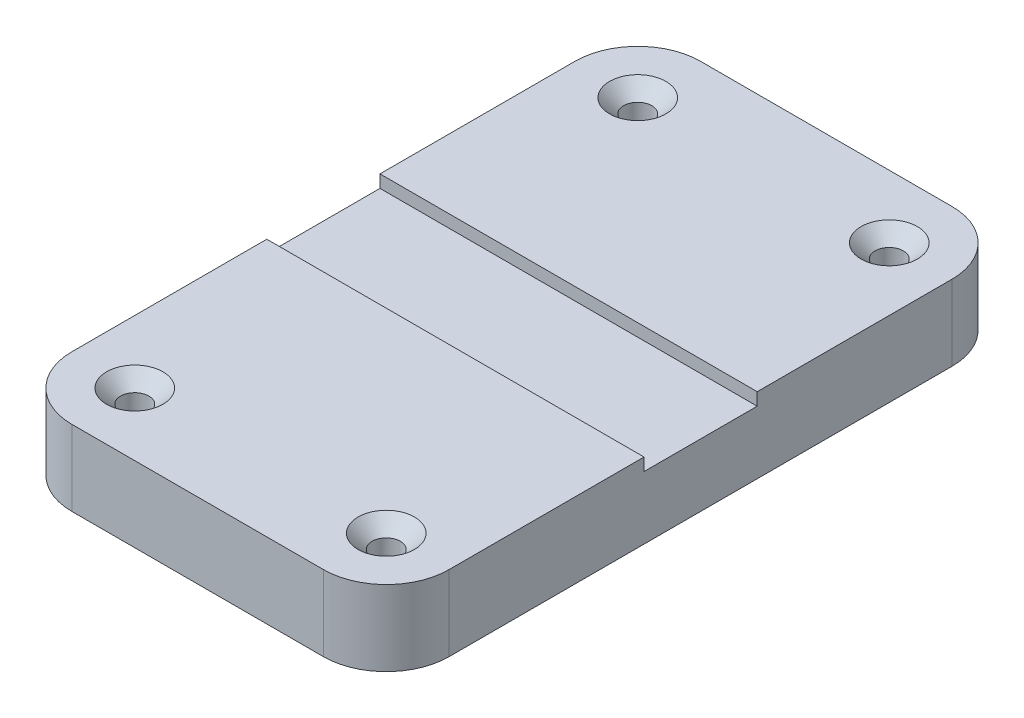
from build123d import *

# Parameters (mm, degrees)
SKETCH1_W                     = 60
SKETCH1_H                     = 100
BOSS_EXTRUDE1_DEPTH           = 12
SKETCH2_W                     = 60
SKETCH2_H                     = 18
CUT_EXTRUDE1_DEPTH            = 2
FILLET1_R                     = 10
CSK_FOR_M4_SFHCS1_D           = 4.5
CSK_FOR_M4_SFHCS1_CSINK_D     = 8.96
CSK_FOR_M4_SFHCS1_CSINK_ANGLE = 90


with BuildPart() as part:
    # Sketch1 → Boss-Extrude1 (new body)
    with BuildSketch(Plane(origin=(0, 0, 0), x_dir=(1, 0, 0), z_dir=(0, 1, 0))):
        with Locations((30, 50)):
            Rectangle(SKETCH1_W, SKETCH1_H)
    extrude(amount=BOSS_EXTRUDE1_DEPTH)

    # Sketch2 → Cut-Extrude1 (cut)
    with BuildSketch(Plane(origin=(0, 12, 0), x_dir=(1, 0, 0), z_dir=(0, 1, 0))):
        with Locations((30, 50)):
            Rectangle(SKETCH2_W, SKETCH2_H)
    extrude(amount=-CUT_EXTRUDE1_DEPTH, mode=Mode.SUBTRACT)

    # Fillet1
    fillet1_edges = [part.edges().sort_by_distance(p)[0] for p in [
        (0, 6, -100),
        (60, 6, -100),
        (60, 6, 0),
        (0, 6, 0),
    ]]
    fillet(fillet1_edges, radius=FILLET1_R)

    # CSK for M4 SFHCS1 (through all)
    with Locations(Plane(origin=(0, 12, 0), x_dir=(1, 0, 0), z_dir=(0, 1, 0))):
        with Locations((10, 10), (50, 10), (10, 90), (50, 90)):
            CounterSinkHole(CSK_FOR_M4_SFHCS1_D / 2, CSK_FOR_M4_SFHCS1_CSINK_D / 2, counter_sink_angle=CSK_FOR_M4_SFHCS1_CSINK_ANGLE)


solid = part.part
